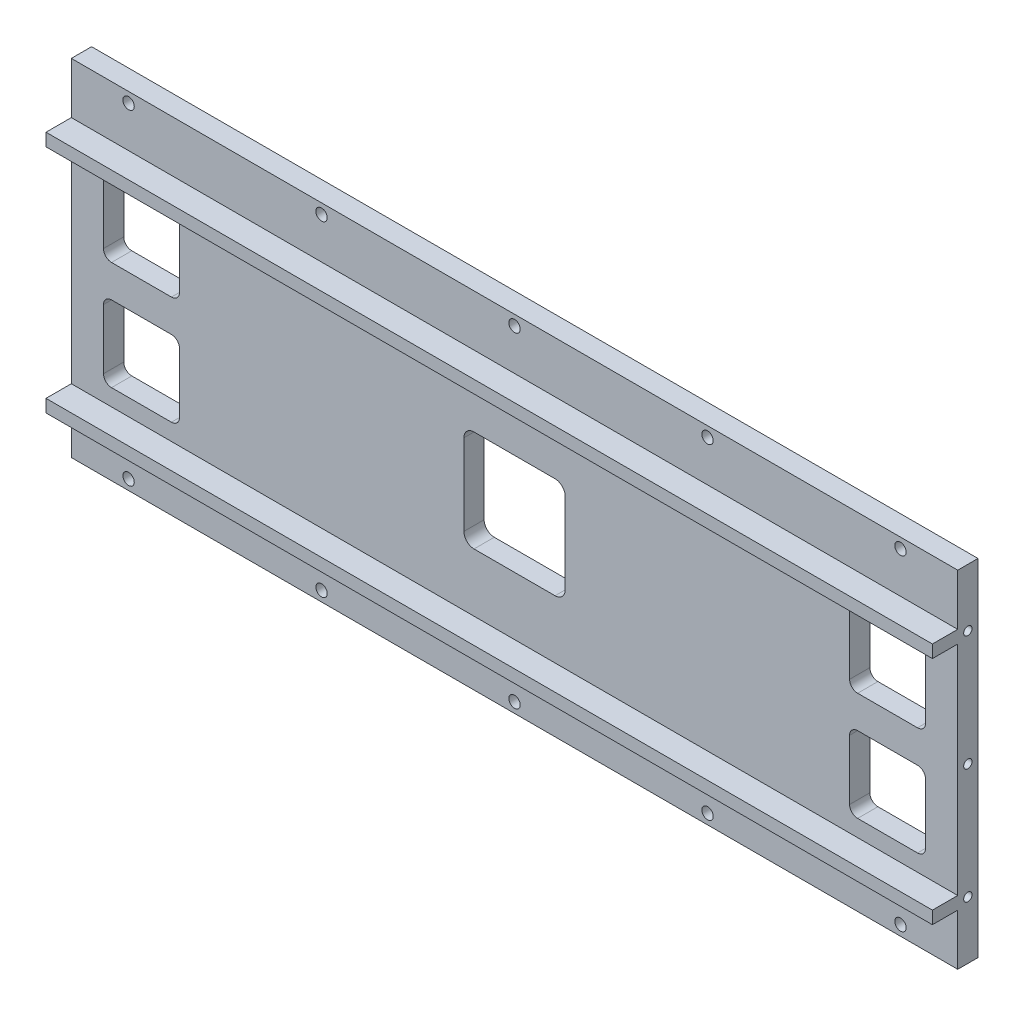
from build123d import *

# Parameters (mm, degrees)
SKETCH1_W               = 350
SKETCH1_H               = 136.5
BOSS_EXTRUDE1_DEPTH     = 8
SKETCH2_W               = 350
SKETCH2_H               = 5
BOSS_EXTRUDE2_DEPTH     = 10
M4_CLEARANCE_HOLE1_D    = 4.5
LPATTERN2_COUNT         = 5
LPATTERN2_PITCH         = 76.2
CUT_EXTRUDE1_REACH      = 190.104
MIRROR4_COPY_1_D        = 4.5
MIRROR4_COPY_2_D        = 4.5
MIRROR4_COPY_3_D        = 4.5
MIRROR4_COPY_4_D        = 4.5
LPATTERN3_COUNT         = 2
LPATTERN3_PITCH         = 45.5
LPATTERN3_COL_COUNT     = 2
LPATTERN3_COL_PITCH     = 45.5
MIRROR2_COPY_1_SKETCH_W = 350
MIRROR2_COPY_1_SKETCH_H = 5
MIRROR2_COPY_1_DEPTH    = 10
MIRROR2_COPY_2_D        = 4.5
MIRROR2_COPY_3_REACH    = 190.104
MIRROR2_COPY_4_D        = 4.5
MIRROR2_COPY_5_D        = 4.5
MIRROR2_COPY_6_D        = 4.5
MIRROR2_COPY_7_D        = 4.5
MIRROR2_COPY_8_SKETCH_W = 350
MIRROR2_COPY_8_SKETCH_H = 5
MIRROR2_COPY_8_DEPTH    = 10
MIRROR2_COPY_9_D        = 4.5
CUT_EXTRUDE2_REACH      = 190.698


with BuildPart() as part:
    # Sketch1 → Boss-Extrude1 (new body)
    with BuildSketch(Plane.XY):
        Rectangle(SKETCH1_W, SKETCH1_H)
    extrude(amount=BOSS_EXTRUDE1_DEPTH)

    # Sketch2 → Boss-Extrude2 (add)
    with BuildSketch(Plane.XY.offset(8)):
        with Locations((0, 45.5)):
            Rectangle(SKETCH2_W, SKETCH2_H)
    boss_extrude2 = extrude(amount=BOSS_EXTRUDE2_DEPTH)

    # M4 Clearance Hole1 (through all)
    with Locations(Plane(origin=(0, 0, 0), x_dir=(-1, 0, 0), z_dir=(0, 0, -1))):
        with Locations((-152.4, 64.25)):
            m4_clearance_hole1 = Hole(M4_CLEARANCE_HOLE1_D / 2)

    # LPattern2: M4 Clearance Hole1 ×5
    with Locations(*[(-i * LPATTERN2_PITCH, 0, 0) for i in range(1, LPATTERN2_COUNT)]):
        add(m4_clearance_hole1, mode=Mode.SUBTRACT)

    # Sketch11 → Cut-Extrude1 (cut, up to next)
    with BuildSketch(Plane.XY.offset(8), mode=Mode.PRIVATE) as cut_extrude1_sk1:
        with BuildLine():
            Line((135.475, 36.4), (159.125, 36.4))
            ThreePointArc((159.125, 36.4), (161.37006403, 35.47006403), (162.3, 33.225))
            Line((162.3, 33.225), (162.3, 9.575))
            ThreePointArc((162.3, 9.575), (161.37006403, 7.32993597), (159.125, 6.4))
            Line((159.125, 6.4), (135.475, 6.4))
            ThreePointArc((135.475, 6.4), (133.22993597, 7.32993597), (132.3, 9.575))
            Line((132.3, 9.575), (132.3, 33.225))
            ThreePointArc((132.3, 33.225), (133.22993597, 35.47006403), (135.475, 36.4))
        make_face()
    cut_extrude1_tool1 = extrude(cut_extrude1_sk1.sketch, amount=-CUT_EXTRUDE1_REACH, mode=Mode.PRIVATE) & part.part
    cut_extrude1 = cut_extrude1_tool1.solids().sort_by_distance((147.3, 21.4, 8))[0]
    add(cut_extrude1, mode=Mode.SUBTRACT)

    # Mirror4: Boss-Extrude2, M4 Clearance Hole1, Cut-Extrude1 across plane
    add(boss_extrude2.mirror(Plane.ZX))
    add(m4_clearance_hole1.mirror(Plane.ZX), mode=Mode.SUBTRACT)
    add(cut_extrude1.mirror(Plane.ZX), mode=Mode.SUBTRACT)

    # Mirror4 copy 1 (through all)
    with Locations(Plane(origin=(-76.2, 0, 0), x_dir=(-1, 0, 0), z_dir=(0, 0, -1))):
        with Locations((-152.4, -64.25)):
            Hole(MIRROR4_COPY_1_D / 2)

    # Mirror4 copy 2 (through all)
    with Locations(Plane(origin=(-152.4, 0, 0), x_dir=(-1, 0, 0), z_dir=(0, 0, -1))):
        with Locations((-152.4, -64.25)):
            Hole(MIRROR4_COPY_2_D / 2)

    # Mirror4 copy 3 (through all)
    with Locations(Plane(origin=(-228.6, 0, 0), x_dir=(-1, 0, 0), z_dir=(0, 0, -1))):
        with Locations((-152.4, -64.25)):
            Hole(MIRROR4_COPY_3_D / 2)

    # Mirror4 copy 4 (through all)
    with Locations(Plane(origin=(-304.8, 0, 0), x_dir=(-1, 0, 0), z_dir=(0, 0, -1))):
        with Locations((-152.4, -64.25)):
            Hole(MIRROR4_COPY_4_D / 2)

    # Sketch10 → M4x0.7 Tapped Hole1 (revolve, cut)
    with BuildSketch(Plane(origin=(175, 0, 4), x_dir=(0, 0, -1), z_dir=(0, 1, 0))):
        Polygon((0, 0), (0, 14.991420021), (1.65, 14), (1.65, 0), align=None)
    m4x0_7_tapped_hole1 = revolve(axis=Axis((181.35, 0, 4), (-1, 0, 0)), mode=Mode.SUBTRACT)

    # LPattern3: M4x0.7 Tapped Hole1 ×2
    with Locations(*[(0, i * LPATTERN3_PITCH, 0) for i in range(1, LPATTERN3_COUNT)]):
        add(m4x0_7_tapped_hole1, mode=Mode.SUBTRACT)

    # LPattern3 col: M4x0.7 Tapped Hole1 ×2
    with Locations(*[(0, -i * LPATTERN3_COL_PITCH, 0) for i in range(1, LPATTERN3_COL_COUNT)]):
        add(m4x0_7_tapped_hole1, mode=Mode.SUBTRACT)

    # Mirror2: Cut-Extrude1, M4x0.7 Tapped Hole1 across plane
    add(cut_extrude1.mirror(Plane(origin=(0, 0, 0), x_dir=(0, 0, 1), z_dir=(1, 0, 0))), mode=Mode.SUBTRACT)
    add(m4x0_7_tapped_hole1.mirror(Plane(origin=(0, 0, 0), x_dir=(0, 0, 1), z_dir=(1, 0, 0))), mode=Mode.SUBTRACT)

    # Mirror2 copy 1 sketch → Mirror2 copy 1 (add)
    with BuildSketch(Plane(origin=(0, 0, 8), x_dir=(-1, 0, 0), z_dir=(0, 0, 1))):
        with Locations((0, 45.5)):
            Rectangle(MIRROR2_COPY_1_SKETCH_W, MIRROR2_COPY_1_SKETCH_H)
    extrude(amount=MIRROR2_COPY_1_DEPTH)

    # Mirror2 copy 2 (through all)
    with Locations(Plane(origin=(0, 0, 0), x_dir=(1, 0, 0), z_dir=(0, 0, -1))):
        with Locations((-152.4, 64.25)):
            Hole(MIRROR2_COPY_2_D / 2)

    # Mirror2 copy 3 sketch → Mirror2 copy 3 (cut, up to next)
    with BuildSketch(Plane(origin=(0, 0, 8), x_dir=(-1, 0, 0), z_dir=(0, 0, 1)), mode=Mode.PRIVATE) as mirror2_copy_3_sk1:
        with BuildLine():
            Line((135.475, 36.4), (159.125, 36.4))
            ThreePointArc((159.125, 36.4), (161.37006403, 35.47006403), (162.3, 33.225))
            Line((162.3, 33.225), (162.3, 9.575))
            ThreePointArc((162.3, 9.575), (161.37006403, 7.32993597), (159.125, 6.4))
            Line((159.125, 6.4), (135.475, 6.4))
            ThreePointArc((135.475, 6.4), (133.22993597, 7.32993597), (132.3, 9.575))
            Line((132.3, 9.575), (132.3, 33.225))
            ThreePointArc((132.3, 33.225), (133.22993597, 35.47006403), (135.475, 36.4))
        make_face()
    mirror2_copy_3_tool1 = extrude(mirror2_copy_3_sk1.sketch, amount=-MIRROR2_COPY_3_REACH, mode=Mode.PRIVATE) & part.part
    add(mirror2_copy_3_tool1.solids().sort_by_distance((-147.3, -21.4, 8))[0], mode=Mode.SUBTRACT)

    # Mirror2 copy 4 (through all)
    with Locations(Plane(origin=(76.2, 0, 0), x_dir=(1, 0, 0), z_dir=(0, 0, -1))):
        with Locations((-152.4, 64.25)):
            Hole(MIRROR2_COPY_4_D / 2)

    # Mirror2 copy 5 (through all)
    with Locations(Plane(origin=(152.4, 0, 0), x_dir=(1, 0, 0), z_dir=(0, 0, -1))):
        with Locations((-152.4, 64.25)):
            Hole(MIRROR2_COPY_5_D / 2)

    # Mirror2 copy 6 (through all)
    with Locations(Plane(origin=(228.6, 0, 0), x_dir=(1, 0, 0), z_dir=(0, 0, -1))):
        with Locations((-152.4, 64.25)):
            Hole(MIRROR2_COPY_6_D / 2)

    # Mirror2 copy 7 (through all)
    with Locations(Plane(origin=(304.8, 0, 0), x_dir=(1, 0, 0), z_dir=(0, 0, -1))):
        with Locations((-152.4, 64.25)):
            Hole(MIRROR2_COPY_7_D / 2)

    # Mirror2 copy 8 sketch → Mirror2 copy 8 (add)
    with BuildSketch(Plane(origin=(0, 0, 8), x_dir=(-1, 0, 0), z_dir=(0, 0, 1))):
        with Locations((0, -45.5)):
            Rectangle(MIRROR2_COPY_8_SKETCH_W, MIRROR2_COPY_8_SKETCH_H)
    extrude(amount=MIRROR2_COPY_8_DEPTH)

    # Mirror2 copy 9 (through all)
    with Locations(Plane(origin=(0, 0, 0), x_dir=(1, 0, 0), z_dir=(0, 0, -1))):
        with Locations((-152.4, -64.25)):
            Hole(MIRROR2_COPY_9_D / 2)

    # Mirror2 copy 10 sketch → Mirror2 copy 10 (revolve, cut)
    with BuildSketch(Plane(origin=(-175, 45.5, 4), x_dir=(0, 0, -1), z_dir=(0, 1, 0))):
        Polygon((0, 0), (0, -14.991420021), (1.65, -14), (1.65, 0), align=None)
    revolve(axis=Axis((-181.35, 45.5, 4), (-1, 0, 0)), mode=Mode.SUBTRACT)

    # Mirror2 copy 11 sketch → Mirror2 copy 11 (revolve, cut)
    with BuildSketch(Plane(origin=(-175, -45.5, 4), x_dir=(0, 0, -1), z_dir=(0, 1, 0))):
        Polygon((0, 0), (0, -14.991420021), (1.65, -14), (1.65, 0), align=None)
    revolve(axis=Axis((-181.35, -45.5, 4), (-1, 0, 0)), mode=Mode.SUBTRACT)

    # Sketch12 → Cut-Extrude2 (cut, up to next)
    with BuildSketch(Plane(origin=(0, 0, 0), x_dir=(-1, 0, 0), z_dir=(0, 0, -1)), mode=Mode.PRIVATE) as cut_extrude2_sk1:
        with BuildLine():
            Line((16, -20), (-16, -20))
            ThreePointArc((-16, -20), (-18.828427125, -18.828427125), (-20, -16))
            Line((-20, -16), (-20, 16))
            ThreePointArc((-20, 16), (-18.828427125, 18.828427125), (-16, 20))
            Line((-16, 20), (16, 20))
            ThreePointArc((16, 20), (18.828427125, 18.828427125), (20, 16))
            Line((20, 16), (20, -16))
            ThreePointArc((20, -16), (18.828427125, -18.828427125), (16, -20))
        make_face()
    cut_extrude2_tool1 = extrude(cut_extrude2_sk1.sketch, amount=-CUT_EXTRUDE2_REACH, mode=Mode.PRIVATE) & part.part
    add(cut_extrude2_tool1.solids().sort_by_distance((0, 0, 0))[0], mode=Mode.SUBTRACT)


solid = part.part
